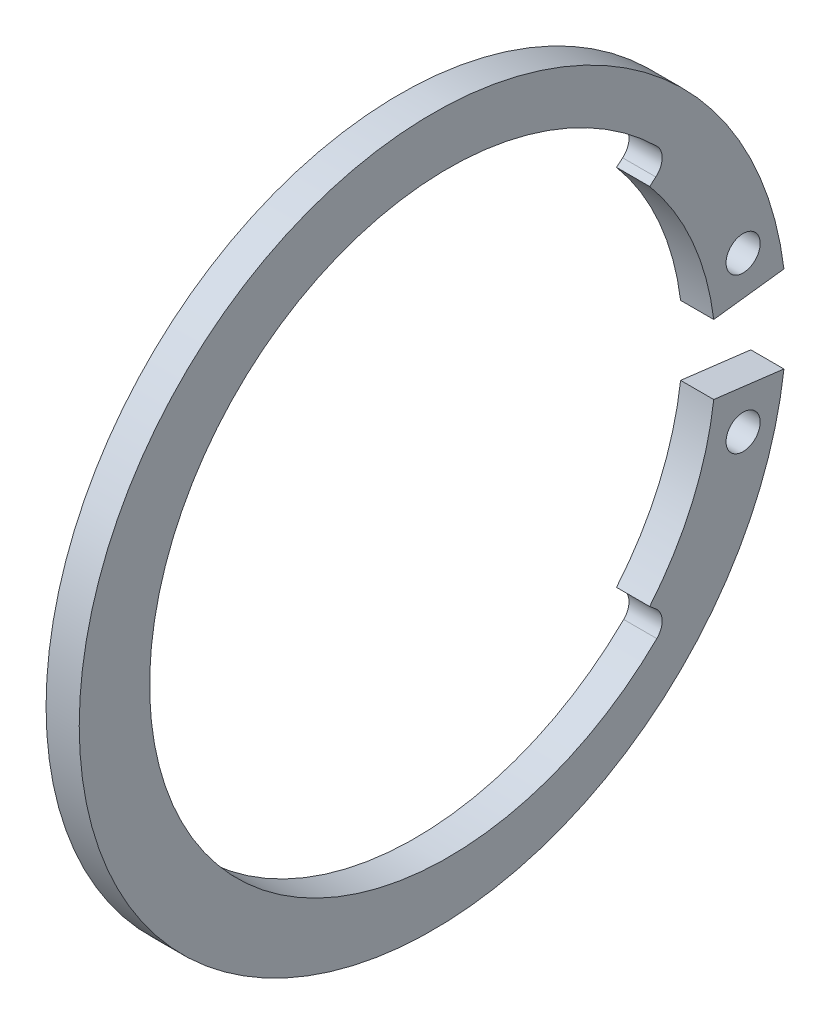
ISO-10303-21;
HEADER;
FILE_DESCRIPTION(('STEP AP214'),'2;1');
FILE_NAME('part.step','',(''),(''),'','','');
FILE_SCHEMA(('AUTOMOTIVE_DESIGN { 1 0 10303 214 1 1 1 1 }'));
ENDSEC;
DATA;
#1=APPLICATION_CONTEXT('core data for automotive mechanical design processes');
#2=APPLICATION_PROTOCOL_DEFINITION('international standard','automotive_design',2000,#1);
#3=PRODUCT_CONTEXT('',#1,'mechanical');
#4=PRODUCT('Part','Part','',(#3));
#5=PRODUCT_RELATED_PRODUCT_CATEGORY('part','',(#4));
#6=PRODUCT_DEFINITION_FORMATION('','',#4);
#7=PRODUCT_DEFINITION_CONTEXT('part definition',#1,'design');
#8=PRODUCT_DEFINITION('design','',#6,#7);
#9=PRODUCT_DEFINITION_SHAPE('','',#8);
#10=(LENGTH_UNIT() NAMED_UNIT(*) SI_UNIT(.MILLI.,.METRE.));
#11=(NAMED_UNIT(*) PLANE_ANGLE_UNIT() SI_UNIT($,.RADIAN.));
#12=(NAMED_UNIT(*) SI_UNIT($,.STERADIAN.) SOLID_ANGLE_UNIT());
#13=UNCERTAINTY_MEASURE_WITH_UNIT(LENGTH_MEASURE(1.E-05),#10,'distance_accuracy_value','');
#14=(GEOMETRIC_REPRESENTATION_CONTEXT(3) GLOBAL_UNCERTAINTY_ASSIGNED_CONTEXT((#13)) GLOBAL_UNIT_ASSIGNED_CONTEXT((#10,
#11,#12)) REPRESENTATION_CONTEXT('',''));
#15=CARTESIAN_POINT('',(0.,0.,0.));
#16=DIRECTION('',(0.,0.,1.));
#17=DIRECTION('',(1.,0.,0.));
#18=AXIS2_PLACEMENT_3D('',#15,#16,#17);
#19=CARTESIAN_POINT('',(0.,-8.22768140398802,-9.80536887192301));
#20=DIRECTION('',(0.,-0.766044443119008,0.642787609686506));
#21=DIRECTION('',(0.,-0.642787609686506,-0.766044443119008));
#22=AXIS2_PLACEMENT_3D('',#19,#20,#21);
#23=PLANE('',#22);
#24=DIRECTION('',(1.,0.,0.));
#25=VECTOR('',#24,1.);
#26=CARTESIAN_POINT('',(0.,-8.22768140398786,-9.80536887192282));
#27=LINE('',#26,#25);
#28=CARTESIAN_POINT('',(1.5,-8.22768140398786,-9.80536887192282));
#29=VERTEX_POINT('',#28);
#30=CARTESIAN_POINT('',(0.,-8.22768140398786,-9.80536887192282));
#31=VERTEX_POINT('',#30);
#32=EDGE_CURVE('E138',#29,#31,#27,.F.);
#33=ORIENTED_EDGE('',*,*,#32,.T.);
#34=DIRECTION('',(0.,-0.642787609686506,-0.766044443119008));
#35=VECTOR('',#34,1.);
#36=CARTESIAN_POINT('',(0.,-8.22768140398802,-9.80536887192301));
#37=LINE('',#36,#35);
#38=CARTESIAN_POINT('',(0.,-8.46159828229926,-10.0841401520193));
#39=VERTEX_POINT('',#38);
#40=EDGE_CURVE('E145',#31,#39,#37,.T.);
#41=ORIENTED_EDGE('',*,*,#40,.T.);
#42=DIRECTION('',(1.,0.,0.));
#43=VECTOR('',#42,1.);
#44=CARTESIAN_POINT('',(0.,-8.46159828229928,-10.0841401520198));
#45=LINE('',#44,#43);
#46=CARTESIAN_POINT('',(1.5,-8.46159828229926,-10.0841401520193));
#47=VERTEX_POINT('',#46);
#48=EDGE_CURVE('E103',#39,#47,#45,.T.);
#49=ORIENTED_EDGE('',*,*,#48,.T.);
#50=DIRECTION('',(0.,-0.642787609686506,-0.766044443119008));
#51=VECTOR('',#50,1.);
#52=CARTESIAN_POINT('',(1.5,-8.22768140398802,-9.80536887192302));
#53=LINE('',#52,#51);
#54=EDGE_CURVE('E88',#47,#29,#53,.F.);
#55=ORIENTED_EDGE('',*,*,#54,.T.);
#56=EDGE_LOOP('',(#33,#41,#49,#55));
#57=FACE_BOUND('',#56,.T.);
#58=ADVANCED_FACE('F14',(#57),#23,.T.);
#59=CARTESIAN_POINT('',(0.,8.46159828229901,-10.08414015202));
#60=DIRECTION('',(0.,0.766044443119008,0.642787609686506));
#61=DIRECTION('',(0.,-0.642787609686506,0.766044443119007));
#62=AXIS2_PLACEMENT_3D('',#59,#60,#61);
#63=PLANE('',#62);
#64=DIRECTION('',(1.,0.,0.));
#65=VECTOR('',#64,1.);
#66=CARTESIAN_POINT('',(0.,8.46159828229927,-10.0841401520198));
#67=LINE('',#66,#65);
#68=CARTESIAN_POINT('',(1.50000000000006,8.4615982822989,-10.0841401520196));
#69=VERTEX_POINT('',#68);
#70=CARTESIAN_POINT('',(0.,8.4615982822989,-10.0841401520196));
#71=VERTEX_POINT('',#70);
#72=EDGE_CURVE('E133',#69,#71,#67,.F.);
#73=ORIENTED_EDGE('',*,*,#72,.T.);
#74=DIRECTION('',(0.,-0.642787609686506,0.766044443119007));
#75=VECTOR('',#74,1.);
#76=CARTESIAN_POINT('',(0.,8.46159828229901,-10.08414015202));
#77=LINE('',#76,#75);
#78=CARTESIAN_POINT('',(0.,8.22768140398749,-9.80536887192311));
#79=VERTEX_POINT('',#78);
#80=EDGE_CURVE('E141',#71,#79,#77,.T.);
#81=ORIENTED_EDGE('',*,*,#80,.T.);
#82=DIRECTION('',(1.,0.,0.));
#83=VECTOR('',#82,1.);
#84=CARTESIAN_POINT('',(0.,8.22768140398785,-9.80536887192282));
#85=LINE('',#84,#83);
#86=CARTESIAN_POINT('',(1.5,8.2276814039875,-9.80536887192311));
#87=VERTEX_POINT('',#86);
#88=EDGE_CURVE('E130',#79,#87,#85,.T.);
#89=ORIENTED_EDGE('',*,*,#88,.T.);
#90=DIRECTION('',(0.,-0.642787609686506,0.766044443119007));
#91=VECTOR('',#90,1.);
#92=CARTESIAN_POINT('',(1.5,8.46159828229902,-10.08414015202));
#93=LINE('',#92,#91);
#94=EDGE_CURVE('E143',#87,#69,#93,.F.);
#95=ORIENTED_EDGE('',*,*,#94,.T.);
#96=EDGE_LOOP('',(#73,#81,#89,#95));
#97=FACE_BOUND('',#96,.T.);
#98=ADVANCED_FACE('F185',(#97),#63,.T.);
#99=CARTESIAN_POINT('',(0.,0.,0.));
#100=DIRECTION('',(1.,0.,0.));
#101=DIRECTION('',(0.,0.,-1.));
#102=AXIS2_PLACEMENT_3D('',#99,#100,#101);
#103=CYLINDRICAL_SURFACE('',#102,12.8);
#104=CARTESIAN_POINT('',(1.5,0.,0.));
#105=DIRECTION('',(1.,0.,0.));
#106=DIRECTION('',(0.,0.,-1.));
#107=AXIS2_PLACEMENT_3D('',#104,#105,#106);
#108=CIRCLE('',#107,12.8);
#109=CARTESIAN_POINT('',(1.50000000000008,-1.56657948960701,-12.7037722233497));
#110=VERTEX_POINT('',#109);
#111=EDGE_CURVE('E173',#110,#29,#108,.F.);
#112=ORIENTED_EDGE('',*,*,#111,.F.);
#113=DIRECTION('',(1.,0.,0.));
#114=VECTOR('',#113,1.);
#115=CARTESIAN_POINT('',(0.,-1.56657948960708,-12.70377222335));
#116=LINE('',#115,#114);
#117=CARTESIAN_POINT('',(0.,-1.56657948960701,-12.7037722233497));
#118=VERTEX_POINT('',#117);
#119=EDGE_CURVE('E115',#118,#110,#116,.T.);
#120=ORIENTED_EDGE('',*,*,#119,.F.);
#121=CARTESIAN_POINT('',(0.,0.,0.));
#122=DIRECTION('',(1.,0.,0.));
#123=DIRECTION('',(0.,0.,-1.));
#124=AXIS2_PLACEMENT_3D('',#121,#122,#123);
#125=CIRCLE('',#124,12.8);
#126=EDGE_CURVE('E164',#118,#31,#125,.F.);
#127=ORIENTED_EDGE('',*,*,#126,.T.);
#128=ORIENTED_EDGE('',*,*,#32,.F.);
#129=EDGE_LOOP('',(#112,#120,#127,#128));
#130=FACE_BOUND('',#129,.T.);
#131=ADVANCED_FACE('F207',(#130),#103,.F.);
#132=CARTESIAN_POINT('',(0.,-9.07443383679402,-9.56991006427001));
#133=DIRECTION('',(1.,0.,0.));
#134=DIRECTION('',(0.,0.,-1.));
#135=AXIS2_PLACEMENT_3D('',#132,#133,#134);
#136=CYLINDRICAL_SURFACE('',#135,0.8);
#137=CARTESIAN_POINT('',(1.5,-9.07443383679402,-9.56991006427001));
#138=DIRECTION('',(1.,0.,0.));
#139=DIRECTION('',(0.,0.,-1.));
#140=AXIS2_PLACEMENT_3D('',#137,#138,#139);
#141=CIRCLE('',#140,0.8);
#142=CARTESIAN_POINT('',(1.5,-9.6460517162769,-10.1296001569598));
#143=VERTEX_POINT('',#142);
#144=EDGE_CURVE('E18',#47,#143,#141,.F.);
#145=ORIENTED_EDGE('',*,*,#144,.F.);
#146=ORIENTED_EDGE('',*,*,#48,.F.);
#147=CARTESIAN_POINT('',(0.,-9.07443383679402,-9.56991006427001));
#148=DIRECTION('',(1.,0.,0.));
#149=DIRECTION('',(0.,0.,-1.));
#150=AXIS2_PLACEMENT_3D('',#147,#148,#149);
#151=CIRCLE('',#150,0.8);
#152=CARTESIAN_POINT('',(0.,-9.64605171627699,-10.1296001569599));
#153=VERTEX_POINT('',#152);
#154=EDGE_CURVE('E99',#39,#153,#151,.F.);
#155=ORIENTED_EDGE('',*,*,#154,.T.);
#156=DIRECTION('',(1.,0.,0.));
#157=VECTOR('',#156,1.);
#158=CARTESIAN_POINT('',(0.,-9.64605171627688,-10.1296001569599));
#159=LINE('',#158,#157);
#160=EDGE_CURVE('E94',#153,#143,#159,.T.);
#161=ORIENTED_EDGE('',*,*,#160,.T.);
#162=EDGE_LOOP('',(#145,#146,#155,#161));
#163=FACE_BOUND('',#162,.T.);
#164=ADVANCED_FACE('F96',(#163),#136,.F.);
#165=CARTESIAN_POINT('',(0.,0.,-0.684829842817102));
#166=DIRECTION('',(1.,0.,0.));
#167=DIRECTION('',(0.,0.,-1.));
#168=AXIS2_PLACEMENT_3D('',#165,#166,#167);
#169=CYLINDRICAL_SURFACE('',#168,13.5);
#170=CARTESIAN_POINT('',(1.5,0.,-0.684829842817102));
#171=DIRECTION('',(1.,0.,0.));
#172=DIRECTION('',(0.,0.,-1.));
#173=AXIS2_PLACEMENT_3D('',#170,#171,#172);
#174=CIRCLE('',#173,13.5);
#175=CARTESIAN_POINT('',(1.5,9.64605171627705,-10.12960015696));
#176=VERTEX_POINT('',#175);
#177=EDGE_CURVE('E106',#143,#176,#174,.F.);
#178=ORIENTED_EDGE('',*,*,#177,.F.);
#179=ORIENTED_EDGE('',*,*,#160,.F.);
#180=CARTESIAN_POINT('',(0.,0.,-0.684829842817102));
#181=DIRECTION('',(1.,0.,0.));
#182=DIRECTION('',(0.,0.,-1.));
#183=AXIS2_PLACEMENT_3D('',#180,#181,#182);
#184=CIRCLE('',#183,13.5);
#185=CARTESIAN_POINT('',(0.,9.64605171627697,-10.1296001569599));
#186=VERTEX_POINT('',#185);
#187=EDGE_CURVE('E161',#153,#186,#184,.F.);
#188=ORIENTED_EDGE('',*,*,#187,.T.);
#189=DIRECTION('',(1.,0.,0.));
#190=VECTOR('',#189,1.);
#191=CARTESIAN_POINT('',(0.,9.64605171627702,-10.12960015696));
#192=LINE('',#191,#190);
#193=EDGE_CURVE('E102',#186,#176,#192,.T.);
#194=ORIENTED_EDGE('',*,*,#193,.T.);
#195=EDGE_LOOP('',(#178,#179,#188,#194));
#196=FACE_BOUND('',#195,.T.);
#197=ADVANCED_FACE('F107',(#196),#169,.F.);
#198=CARTESIAN_POINT('',(0.,9.07443383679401,-9.56991006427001));
#199=DIRECTION('',(1.,0.,0.));
#200=DIRECTION('',(0.,0.,-1.));
#201=AXIS2_PLACEMENT_3D('',#198,#199,#200);
#202=CYLINDRICAL_SURFACE('',#201,0.8);
#203=CARTESIAN_POINT('',(1.5,9.07443383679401,-9.56991006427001));
#204=DIRECTION('',(1.,0.,0.));
#205=DIRECTION('',(0.,0.,-1.));
#206=AXIS2_PLACEMENT_3D('',#203,#204,#205);
#207=CIRCLE('',#206,0.8);
#208=EDGE_CURVE('E111',#176,#69,#207,.F.);
#209=ORIENTED_EDGE('',*,*,#208,.F.);
#210=ORIENTED_EDGE('',*,*,#193,.F.);
#211=CARTESIAN_POINT('',(0.,9.07443383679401,-9.56991006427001));
#212=DIRECTION('',(1.,0.,0.));
#213=DIRECTION('',(0.,0.,-1.));
#214=AXIS2_PLACEMENT_3D('',#211,#212,#213);
#215=CIRCLE('',#214,0.8);
#216=EDGE_CURVE('E158',#186,#71,#215,.F.);
#217=ORIENTED_EDGE('',*,*,#216,.T.);
#218=ORIENTED_EDGE('',*,*,#72,.F.);
#219=EDGE_LOOP('',(#209,#210,#217,#218));
#220=FACE_BOUND('',#219,.T.);
#221=ADVANCED_FACE('F182',(#220),#202,.F.);
#222=CARTESIAN_POINT('',(0.,0.,0.));
#223=DIRECTION('',(1.,0.,0.));
#224=DIRECTION('',(0.,0.,-1.));
#225=AXIS2_PLACEMENT_3D('',#222,#223,#224);
#226=CYLINDRICAL_SURFACE('',#225,12.8);
#227=CARTESIAN_POINT('',(1.5,0.,0.));
#228=DIRECTION('',(1.,0.,0.));
#229=DIRECTION('',(0.,0.,-1.));
#230=AXIS2_PLACEMENT_3D('',#227,#228,#229);
#231=CIRCLE('',#230,12.8);
#232=CARTESIAN_POINT('',(1.50000000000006,1.56657948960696,-12.7037722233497));
#233=VERTEX_POINT('',#232);
#234=EDGE_CURVE('E176',#87,#233,#231,.F.);
#235=ORIENTED_EDGE('',*,*,#234,.F.);
#236=ORIENTED_EDGE('',*,*,#88,.F.);
#237=CARTESIAN_POINT('',(0.,0.,0.));
#238=DIRECTION('',(1.,0.,0.));
#239=DIRECTION('',(0.,0.,-1.));
#240=AXIS2_PLACEMENT_3D('',#237,#238,#239);
#241=CIRCLE('',#240,12.8);
#242=CARTESIAN_POINT('',(0.,1.56657948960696,-12.7037722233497));
#243=VERTEX_POINT('',#242);
#244=EDGE_CURVE('E156',#79,#243,#241,.F.);
#245=ORIENTED_EDGE('',*,*,#244,.T.);
#246=DIRECTION('',(1.,0.,0.));
#247=VECTOR('',#246,1.);
#248=CARTESIAN_POINT('',(0.,1.566579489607,-12.70377222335));
#249=LINE('',#248,#247);
#250=EDGE_CURVE('E121',#233,#243,#249,.F.);
#251=ORIENTED_EDGE('',*,*,#250,.F.);
#252=EDGE_LOOP('',(#235,#236,#245,#251));
#253=FACE_BOUND('',#252,.T.);
#254=ADVANCED_FACE('F190',(#253),#226,.F.);
#255=CARTESIAN_POINT('',(0.,1.566579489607,-12.70377222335));
#256=DIRECTION('',(0.,-0.992482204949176,-0.122389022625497));
#257=DIRECTION('',(0.,0.122389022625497,-0.992482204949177));
#258=AXIS2_PLACEMENT_3D('',#255,#256,#257);
#259=PLANE('',#258);
#260=ORIENTED_EDGE('',*,*,#250,.T.);
#261=DIRECTION('',(0.,0.122389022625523,-0.992482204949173));
#262=VECTOR('',#261,1.);
#263=CARTESIAN_POINT('',(0.,1.566579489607,-12.70377222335));
#264=LINE('',#263,#262);
#265=CARTESIAN_POINT('',(0.,1.95822436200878,-15.8797152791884));
#266=VERTEX_POINT('',#265);
#267=EDGE_CURVE('E124',#243,#266,#264,.T.);
#268=ORIENTED_EDGE('',*,*,#267,.T.);
#269=DIRECTION('',(1.,0.,0.));
#270=VECTOR('',#269,1.);
#271=CARTESIAN_POINT('',(0.,1.95822436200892,-15.87971527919));
#272=LINE('',#271,#270);
#273=CARTESIAN_POINT('',(1.5,1.95822436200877,-15.8797152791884));
#274=VERTEX_POINT('',#273);
#275=EDGE_CURVE('E32',#266,#274,#272,.T.);
#276=ORIENTED_EDGE('',*,*,#275,.T.);
#277=DIRECTION('',(0.,0.122389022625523,-0.992482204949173));
#278=VECTOR('',#277,1.);
#279=CARTESIAN_POINT('',(1.50000000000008,1.566579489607,-12.70377222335));
#280=LINE('',#279,#278);
#281=EDGE_CURVE('E179',#233,#274,#280,.T.);
#282=ORIENTED_EDGE('',*,*,#281,.F.);
#283=EDGE_LOOP('',(#260,#268,#276,#282));
#284=FACE_BOUND('',#283,.T.);
#285=ADVANCED_FACE('F202',(#284),#259,.T.);
#286=CARTESIAN_POINT('',(0.,-1.958224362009,-15.87971527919));
#287=DIRECTION('',(0.,0.992482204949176,-0.122389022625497));
#288=DIRECTION('',(0.,0.122389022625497,0.992482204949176));
#289=AXIS2_PLACEMENT_3D('',#286,#287,#288);
#290=PLANE('',#289);
#291=DIRECTION('',(1.,0.,0.));
#292=VECTOR('',#291,1.);
#293=CARTESIAN_POINT('',(0.,-1.958224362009,-15.87971527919));
#294=LINE('',#293,#292);
#295=CARTESIAN_POINT('',(1.5,-1.9582243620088,-15.8797152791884));
#296=VERTEX_POINT('',#295);
#297=CARTESIAN_POINT('',(0.,-1.9582243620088,-15.8797152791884));
#298=VERTEX_POINT('',#297);
#299=EDGE_CURVE('E114',#296,#298,#294,.F.);
#300=ORIENTED_EDGE('',*,*,#299,.T.);
#301=DIRECTION('',(0.,0.122389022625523,0.992482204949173));
#302=VECTOR('',#301,1.);
#303=CARTESIAN_POINT('',(0.,-1.958224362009,-15.87971527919));
#304=LINE('',#303,#302);
#305=EDGE_CURVE('E155',#298,#118,#304,.T.);
#306=ORIENTED_EDGE('',*,*,#305,.T.);
#307=ORIENTED_EDGE('',*,*,#119,.T.);
#308=DIRECTION('',(0.,0.122389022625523,0.992482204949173));
#309=VECTOR('',#308,1.);
#310=CARTESIAN_POINT('',(1.49999999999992,-1.958224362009,-15.87971527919));
#311=LINE('',#310,#309);
#312=EDGE_CURVE('E175',#296,#110,#311,.T.);
#313=ORIENTED_EDGE('',*,*,#312,.F.);
#314=EDGE_LOOP('',(#300,#306,#307,#313));
#315=FACE_BOUND('',#314,.T.);
#316=ADVANCED_FACE('F197',(#315),#290,.T.);
#317=CARTESIAN_POINT('',(0.,-3.50000000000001,-14.03300543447));
#318=DIRECTION('',(1.,0.,0.));
#319=DIRECTION('',(0.,0.,-1.));
#320=AXIS2_PLACEMENT_3D('',#317,#318,#319);
#321=CYLINDRICAL_SURFACE('',#320,0.7720169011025);
#322=CARTESIAN_POINT('',(1.49999999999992,-3.5,-14.03300543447));
#323=DIRECTION('',(1.,0.,0.));
#324=DIRECTION('',(0.,0.,-1.));
#325=AXIS2_PLACEMENT_3D('',#322,#323,#324);
#326=CIRCLE('',#325,0.7720169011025);
#327=CARTESIAN_POINT('',(1.49999999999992,-3.5,-14.8050223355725));
#328=VERTEX_POINT('',#327);
#329=EDGE_CURVE('E170',#328,#328,#326,.F.);
#330=ORIENTED_EDGE('',*,*,#329,.F.);
#331=EDGE_LOOP('',(#330));
#332=FACE_BOUND('',#331,.T.);
#333=CARTESIAN_POINT('',(0.,-3.50000000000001,-14.03300543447));
#334=DIRECTION('',(1.,0.,0.));
#335=DIRECTION('',(0.,0.,-1.));
#336=AXIS2_PLACEMENT_3D('',#333,#334,#335);
#337=CIRCLE('',#336,0.7720169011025);
#338=CARTESIAN_POINT('',(0.,-3.50000000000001,-14.8050223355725));
#339=VERTEX_POINT('',#338);
#340=EDGE_CURVE('E152',#339,#339,#337,.F.);
#341=ORIENTED_EDGE('',*,*,#340,.T.);
#342=EDGE_LOOP('',(#341));
#343=FACE_BOUND('',#342,.T.);
#344=ADVANCED_FACE('F232',(#332,#343),#321,.F.);
#345=CARTESIAN_POINT('',(0.,3.5,-14.03300543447));
#346=DIRECTION('',(1.,0.,0.));
#347=DIRECTION('',(0.,0.,-1.));
#348=AXIS2_PLACEMENT_3D('',#345,#346,#347);
#349=CYLINDRICAL_SURFACE('',#348,0.7720169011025);
#350=CARTESIAN_POINT('',(1.5,3.5,-14.03300543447));
#351=DIRECTION('',(1.,0.,0.));
#352=DIRECTION('',(0.,0.,-1.));
#353=AXIS2_PLACEMENT_3D('',#350,#351,#352);
#354=CIRCLE('',#353,0.7720169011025);
#355=CARTESIAN_POINT('',(1.5,3.5,-14.8050223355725));
#356=VERTEX_POINT('',#355);
#357=EDGE_CURVE('E167',#356,#356,#354,.F.);
#358=ORIENTED_EDGE('',*,*,#357,.F.);
#359=EDGE_LOOP('',(#358));
#360=FACE_BOUND('',#359,.T.);
#361=CARTESIAN_POINT('',(0.,3.5,-14.03300543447));
#362=DIRECTION('',(1.,0.,0.));
#363=DIRECTION('',(0.,0.,-1.));
#364=AXIS2_PLACEMENT_3D('',#361,#362,#363);
#365=CIRCLE('',#364,0.7720169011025);
#366=CARTESIAN_POINT('',(0.,3.5,-14.8050223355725));
#367=VERTEX_POINT('',#366);
#368=EDGE_CURVE('E149',#367,#367,#365,.F.);
#369=ORIENTED_EDGE('',*,*,#368,.T.);
#370=EDGE_LOOP('',(#369));
#371=FACE_BOUND('',#370,.T.);
#372=ADVANCED_FACE('F224',(#360,#371),#349,.F.);
#373=CARTESIAN_POINT('',(1.5,0.,0.));
#374=DIRECTION('',(1.,0.,0.));
#375=DIRECTION('',(0.,0.,-1.));
#376=AXIS2_PLACEMENT_3D('',#373,#374,#375);
#377=PLANE('',#376);
#378=ORIENTED_EDGE('',*,*,#357,.T.);
#379=EDGE_LOOP('',(#378));
#380=FACE_BOUND('',#379,.T.);
#381=ORIENTED_EDGE('',*,*,#329,.T.);
#382=EDGE_LOOP('',(#381));
#383=FACE_BOUND('',#382,.T.);
#384=ORIENTED_EDGE('',*,*,#312,.T.);
#385=ORIENTED_EDGE('',*,*,#111,.T.);
#386=ORIENTED_EDGE('',*,*,#54,.F.);
#387=ORIENTED_EDGE('',*,*,#144,.T.);
#388=ORIENTED_EDGE('',*,*,#177,.T.);
#389=ORIENTED_EDGE('',*,*,#208,.T.);
#390=ORIENTED_EDGE('',*,*,#94,.F.);
#391=ORIENTED_EDGE('',*,*,#234,.T.);
#392=ORIENTED_EDGE('',*,*,#281,.T.);
#393=CARTESIAN_POINT('',(1.5,0.,0.));
#394=DIRECTION('',(1.,0.,0.));
#395=DIRECTION('',(0.,0.,-1.));
#396=AXIS2_PLACEMENT_3D('',#393,#394,#395);
#397=CIRCLE('',#396,16.);
#398=EDGE_CURVE('E24',#296,#274,#397,.F.);
#399=ORIENTED_EDGE('',*,*,#398,.F.);
#400=EDGE_LOOP('',(#384,#385,#386,#387,#388,#389,#390,#391,#392,#399));
#401=FACE_BOUND('',#400,.T.);
#402=ADVANCED_FACE('F113',(#380,#383,#401),#377,.T.);
#403=CARTESIAN_POINT('',(0.,0.,0.));
#404=DIRECTION('',(1.,0.,0.));
#405=DIRECTION('',(0.,0.,-1.));
#406=AXIS2_PLACEMENT_3D('',#403,#404,#405);
#407=PLANE('',#406);
#408=ORIENTED_EDGE('',*,*,#368,.F.);
#409=EDGE_LOOP('',(#408));
#410=FACE_BOUND('',#409,.T.);
#411=ORIENTED_EDGE('',*,*,#340,.F.);
#412=EDGE_LOOP('',(#411));
#413=FACE_BOUND('',#412,.T.);
#414=CARTESIAN_POINT('',(0.,0.,0.));
#415=DIRECTION('',(1.,0.,0.));
#416=DIRECTION('',(0.,0.,-1.));
#417=AXIS2_PLACEMENT_3D('',#414,#415,#416);
#418=CIRCLE('',#417,16.);
#419=EDGE_CURVE('E9',#266,#298,#418,.T.);
#420=ORIENTED_EDGE('',*,*,#419,.F.);
#421=ORIENTED_EDGE('',*,*,#267,.F.);
#422=ORIENTED_EDGE('',*,*,#244,.F.);
#423=ORIENTED_EDGE('',*,*,#80,.F.);
#424=ORIENTED_EDGE('',*,*,#216,.F.);
#425=ORIENTED_EDGE('',*,*,#187,.F.);
#426=ORIENTED_EDGE('',*,*,#154,.F.);
#427=ORIENTED_EDGE('',*,*,#40,.F.);
#428=ORIENTED_EDGE('',*,*,#126,.F.);
#429=ORIENTED_EDGE('',*,*,#305,.F.);
#430=EDGE_LOOP('',(#420,#421,#422,#423,#424,#425,#426,#427,#428,#429));
#431=FACE_BOUND('',#430,.T.);
#432=ADVANCED_FACE('F204',(#410,#413,#431),#407,.F.);
#433=CARTESIAN_POINT('',(0.,0.,0.));
#434=DIRECTION('',(1.,0.,0.));
#435=DIRECTION('',(0.,0.,-1.));
#436=AXIS2_PLACEMENT_3D('',#433,#434,#435);
#437=CYLINDRICAL_SURFACE('',#436,16.);
#438=ORIENTED_EDGE('',*,*,#275,.F.);
#439=ORIENTED_EDGE('',*,*,#419,.T.);
#440=ORIENTED_EDGE('',*,*,#299,.F.);
#441=ORIENTED_EDGE('',*,*,#398,.T.);
#442=EDGE_LOOP('',(#438,#439,#440,#441));
#443=FACE_BOUND('',#442,.T.);
#444=ADVANCED_FACE('F16',(#443),#437,.T.);
#445=CLOSED_SHELL('',(#58,#98,#131,#164,#197,#221,#254,#285,#316,#344,#372,#402,#432,#444));
#446=MANIFOLD_SOLID_BREP('B1',#445);
#447=ADVANCED_BREP_SHAPE_REPRESENTATION('',(#18,#446),#14);
#448=SHAPE_DEFINITION_REPRESENTATION(#9,#447);
ENDSEC;
END-ISO-10303-21;
